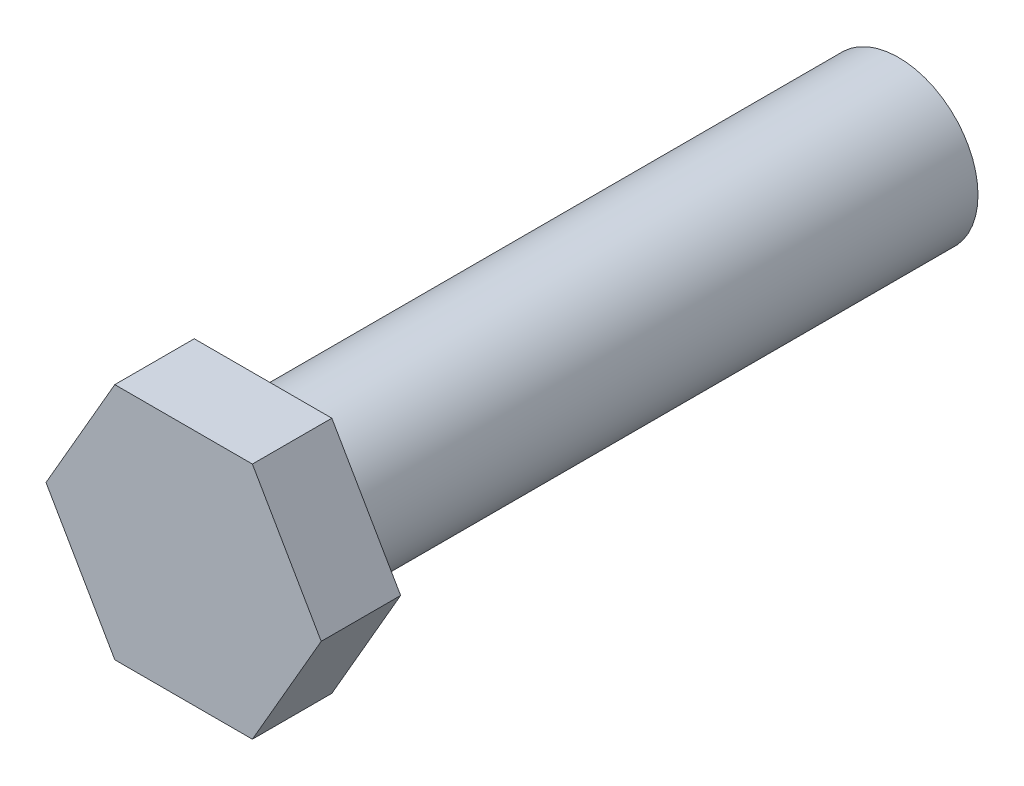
ISO-10303-21;
HEADER;
FILE_DESCRIPTION(('STEP AP214'),'2;1');
FILE_NAME('part.step','',(''),(''),'','','');
FILE_SCHEMA(('AUTOMOTIVE_DESIGN { 1 0 10303 214 1 1 1 1 }'));
ENDSEC;
DATA;
#1=APPLICATION_CONTEXT('core data for automotive mechanical design processes');
#2=APPLICATION_PROTOCOL_DEFINITION('international standard','automotive_design',2000,#1);
#3=PRODUCT_CONTEXT('',#1,'mechanical');
#4=PRODUCT('Part','Part','',(#3));
#5=PRODUCT_RELATED_PRODUCT_CATEGORY('part','',(#4));
#6=PRODUCT_DEFINITION_FORMATION('','',#4);
#7=PRODUCT_DEFINITION_CONTEXT('part definition',#1,'design');
#8=PRODUCT_DEFINITION('design','',#6,#7);
#9=PRODUCT_DEFINITION_SHAPE('','',#8);
#10=(LENGTH_UNIT() NAMED_UNIT(*) SI_UNIT(.MILLI.,.METRE.));
#11=(NAMED_UNIT(*) PLANE_ANGLE_UNIT() SI_UNIT($,.RADIAN.));
#12=(NAMED_UNIT(*) SI_UNIT($,.STERADIAN.) SOLID_ANGLE_UNIT());
#13=UNCERTAINTY_MEASURE_WITH_UNIT(LENGTH_MEASURE(1.E-05),#10,'distance_accuracy_value','');
#14=(GEOMETRIC_REPRESENTATION_CONTEXT(3) GLOBAL_UNCERTAINTY_ASSIGNED_CONTEXT((#13)) GLOBAL_UNIT_ASSIGNED_CONTEXT((#10,
#11,#12)) REPRESENTATION_CONTEXT('',''));
#15=CARTESIAN_POINT('',(0.,0.,0.));
#16=DIRECTION('',(0.,0.,1.));
#17=DIRECTION('',(1.,0.,0.));
#18=AXIS2_PLACEMENT_3D('',#15,#16,#17);
#19=CARTESIAN_POINT('',(0.,0.,40.));
#20=DIRECTION('',(0.,0.,-1.));
#21=DIRECTION('',(-1.,0.,0.));
#22=AXIS2_PLACEMENT_3D('',#19,#20,#21);
#23=CYLINDRICAL_SURFACE('',#22,5.);
#24=CARTESIAN_POINT('',(0.,0.,40.));
#25=DIRECTION('',(0.,0.,1.));
#26=DIRECTION('',(1.,0.,0.));
#27=AXIS2_PLACEMENT_3D('',#24,#25,#26);
#28=CIRCLE('',#27,5.);
#29=CARTESIAN_POINT('',(5.,0.,40.));
#30=VERTEX_POINT('',#29);
#31=EDGE_CURVE('E11',#30,#30,#28,.T.);
#32=ORIENTED_EDGE('',*,*,#31,.F.);
#33=EDGE_LOOP('',(#32));
#34=FACE_BOUND('',#33,.T.);
#35=CARTESIAN_POINT('',(0.,0.,0.));
#36=DIRECTION('',(0.,0.,1.));
#37=DIRECTION('',(1.,0.,0.));
#38=AXIS2_PLACEMENT_3D('',#35,#36,#37);
#39=CIRCLE('',#38,5.);
#40=CARTESIAN_POINT('',(5.,0.,0.));
#41=VERTEX_POINT('',#40);
#42=EDGE_CURVE('E357',#41,#41,#39,.T.);
#43=ORIENTED_EDGE('',*,*,#42,.T.);
#44=EDGE_LOOP('',(#43));
#45=FACE_BOUND('',#44,.T.);
#46=ADVANCED_FACE('F350',(#34,#45),#23,.T.);
#47=CARTESIAN_POINT('',(0.,0.,0.));
#48=DIRECTION('',(0.,0.,1.));
#49=DIRECTION('',(1.,0.,0.));
#50=AXIS2_PLACEMENT_3D('',#47,#48,#49);
#51=PLANE('',#50);
#52=ORIENTED_EDGE('',*,*,#42,.F.);
#53=EDGE_LOOP('',(#52));
#54=FACE_BOUND('',#53,.T.);
#55=ADVANCED_FACE('F458',(#54),#51,.F.);
#56=CARTESIAN_POINT('',(4.3301270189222,-7.5,40.));
#57=DIRECTION('',(0.,0.,-1.));
#58=DIRECTION('',(-1.,0.,0.));
#59=AXIS2_PLACEMENT_3D('',#56,#57,#58);
#60=PLANE('',#59);
#61=DIRECTION('',(0.5,0.866025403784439,0.));
#62=VECTOR('',#61,1.);
#63=CARTESIAN_POINT('',(4.33012701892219,-7.5,40.));
#64=LINE('',#63,#62);
#65=CARTESIAN_POINT('',(4.33012701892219,-7.5,40.));
#66=VERTEX_POINT('',#65);
#67=CARTESIAN_POINT('',(8.66025403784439,0.,40.));
#68=VERTEX_POINT('',#67);
#69=EDGE_CURVE('E408',#66,#68,#64,.T.);
#70=ORIENTED_EDGE('',*,*,#69,.F.);
#71=DIRECTION('',(1.,0.,0.));
#72=VECTOR('',#71,1.);
#73=CARTESIAN_POINT('',(-4.3301270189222,-7.5,40.));
#74=LINE('',#73,#72);
#75=CARTESIAN_POINT('',(-4.3301270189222,-7.5,40.));
#76=VERTEX_POINT('',#75);
#77=EDGE_CURVE('E433',#76,#66,#74,.T.);
#78=ORIENTED_EDGE('',*,*,#77,.F.);
#79=DIRECTION('',(0.5,-0.866025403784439,0.));
#80=VECTOR('',#79,1.);
#81=CARTESIAN_POINT('',(-8.66025403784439,0.,40.));
#82=LINE('',#81,#80);
#83=CARTESIAN_POINT('',(-8.66025403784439,0.,40.));
#84=VERTEX_POINT('',#83);
#85=EDGE_CURVE('E431',#84,#76,#82,.T.);
#86=ORIENTED_EDGE('',*,*,#85,.F.);
#87=DIRECTION('',(-0.5,-0.866025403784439,0.));
#88=VECTOR('',#87,1.);
#89=CARTESIAN_POINT('',(-4.3301270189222,7.5,40.));
#90=LINE('',#89,#88);
#91=CARTESIAN_POINT('',(-4.3301270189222,7.5,40.));
#92=VERTEX_POINT('',#91);
#93=EDGE_CURVE('E429',#92,#84,#90,.T.);
#94=ORIENTED_EDGE('',*,*,#93,.F.);
#95=DIRECTION('',(-1.,0.,0.));
#96=VECTOR('',#95,1.);
#97=CARTESIAN_POINT('',(4.33012701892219,7.50000000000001,40.));
#98=LINE('',#97,#96);
#99=CARTESIAN_POINT('',(4.33012701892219,7.50000000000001,40.));
#100=VERTEX_POINT('',#99);
#101=EDGE_CURVE('E410',#100,#92,#98,.T.);
#102=ORIENTED_EDGE('',*,*,#101,.F.);
#103=DIRECTION('',(-0.5,0.866025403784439,0.));
#104=VECTOR('',#103,1.);
#105=CARTESIAN_POINT('',(8.66025403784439,0.,40.));
#106=LINE('',#105,#104);
#107=EDGE_CURVE('E402',#68,#100,#106,.T.);
#108=ORIENTED_EDGE('',*,*,#107,.F.);
#109=EDGE_LOOP('',(#70,#78,#86,#94,#102,#108));
#110=FACE_BOUND('',#109,.T.);
#111=ORIENTED_EDGE('',*,*,#31,.T.);
#112=EDGE_LOOP('',(#111));
#113=FACE_BOUND('',#112,.T.);
#114=ADVANCED_FACE('F404',(#110,#113),#60,.T.);
#115=CARTESIAN_POINT('',(4.33012701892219,-7.5,45.));
#116=DIRECTION('',(-0.866025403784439,0.5,0.));
#117=DIRECTION('',(-0.5,-0.866025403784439,0.));
#118=AXIS2_PLACEMENT_3D('',#115,#116,#117);
#119=PLANE('',#118);
#120=ORIENTED_EDGE('',*,*,#69,.T.);
#121=DIRECTION('',(0.,0.,-1.));
#122=VECTOR('',#121,1.);
#123=CARTESIAN_POINT('',(8.66025403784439,0.,45.));
#124=LINE('',#123,#122);
#125=CARTESIAN_POINT('',(8.66025403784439,0.,45.));
#126=VERTEX_POINT('',#125);
#127=EDGE_CURVE('E416',#126,#68,#124,.T.);
#128=ORIENTED_EDGE('',*,*,#127,.F.);
#129=DIRECTION('',(0.5,0.866025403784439,0.));
#130=VECTOR('',#129,1.);
#131=CARTESIAN_POINT('',(4.33012701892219,-7.5,45.));
#132=LINE('',#131,#130);
#133=CARTESIAN_POINT('',(4.33012701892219,-7.5,45.));
#134=VERTEX_POINT('',#133);
#135=EDGE_CURVE('E435',#134,#126,#132,.T.);
#136=ORIENTED_EDGE('',*,*,#135,.F.);
#137=DIRECTION('',(0.,0.,-1.));
#138=VECTOR('',#137,1.);
#139=CARTESIAN_POINT('',(4.33012701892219,-7.5,45.));
#140=LINE('',#139,#138);
#141=EDGE_CURVE('E425',#134,#66,#140,.T.);
#142=ORIENTED_EDGE('',*,*,#141,.T.);
#143=EDGE_LOOP('',(#120,#128,#136,#142));
#144=FACE_BOUND('',#143,.T.);
#145=ADVANCED_FACE('F424',(#144),#119,.F.);
#146=CARTESIAN_POINT('',(8.66025403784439,0.,45.));
#147=DIRECTION('',(-0.866025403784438,-0.5,0.));
#148=DIRECTION('',(0.5,-0.866025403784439,0.));
#149=AXIS2_PLACEMENT_3D('',#146,#147,#148);
#150=PLANE('',#149);
#151=ORIENTED_EDGE('',*,*,#107,.T.);
#152=DIRECTION('',(0.,0.,-1.));
#153=VECTOR('',#152,1.);
#154=CARTESIAN_POINT('',(4.33012701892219,7.50000000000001,45.));
#155=LINE('',#154,#153);
#156=CARTESIAN_POINT('',(4.33012701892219,7.50000000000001,45.));
#157=VERTEX_POINT('',#156);
#158=EDGE_CURVE('E421',#157,#100,#155,.T.);
#159=ORIENTED_EDGE('',*,*,#158,.F.);
#160=DIRECTION('',(-0.5,0.866025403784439,0.));
#161=VECTOR('',#160,1.);
#162=CARTESIAN_POINT('',(8.66025403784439,0.,45.));
#163=LINE('',#162,#161);
#164=EDGE_CURVE('E418',#126,#157,#163,.T.);
#165=ORIENTED_EDGE('',*,*,#164,.F.);
#166=ORIENTED_EDGE('',*,*,#127,.T.);
#167=EDGE_LOOP('',(#151,#159,#165,#166));
#168=FACE_BOUND('',#167,.T.);
#169=ADVANCED_FACE('F417',(#168),#150,.F.);
#170=CARTESIAN_POINT('',(4.33012701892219,7.50000000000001,45.));
#171=DIRECTION('',(0.,-1.,0.));
#172=DIRECTION('',(1.,0.,0.));
#173=AXIS2_PLACEMENT_3D('',#170,#171,#172);
#174=PLANE('',#173);
#175=ORIENTED_EDGE('',*,*,#101,.T.);
#176=DIRECTION('',(0.,0.,-1.));
#177=VECTOR('',#176,1.);
#178=CARTESIAN_POINT('',(-4.3301270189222,7.5,45.));
#179=LINE('',#178,#177);
#180=CARTESIAN_POINT('',(-4.3301270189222,7.5,45.));
#181=VERTEX_POINT('',#180);
#182=EDGE_CURVE('E451',#181,#92,#179,.T.);
#183=ORIENTED_EDGE('',*,*,#182,.F.);
#184=DIRECTION('',(-1.,0.,0.));
#185=VECTOR('',#184,1.);
#186=CARTESIAN_POINT('',(4.33012701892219,7.50000000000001,45.));
#187=LINE('',#186,#185);
#188=EDGE_CURVE('E438',#157,#181,#187,.T.);
#189=ORIENTED_EDGE('',*,*,#188,.F.);
#190=ORIENTED_EDGE('',*,*,#158,.T.);
#191=EDGE_LOOP('',(#175,#183,#189,#190));
#192=FACE_BOUND('',#191,.T.);
#193=ADVANCED_FACE('F471',(#192),#174,.F.);
#194=CARTESIAN_POINT('',(-4.3301270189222,7.5,45.));
#195=DIRECTION('',(0.866025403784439,-0.5,0.));
#196=DIRECTION('',(0.5,0.866025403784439,0.));
#197=AXIS2_PLACEMENT_3D('',#194,#195,#196);
#198=PLANE('',#197);
#199=ORIENTED_EDGE('',*,*,#93,.T.);
#200=DIRECTION('',(0.,0.,-1.));
#201=VECTOR('',#200,1.);
#202=CARTESIAN_POINT('',(-8.66025403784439,0.,45.));
#203=LINE('',#202,#201);
#204=CARTESIAN_POINT('',(-8.66025403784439,0.,45.));
#205=VERTEX_POINT('',#204);
#206=EDGE_CURVE('E448',#205,#84,#203,.T.);
#207=ORIENTED_EDGE('',*,*,#206,.F.);
#208=DIRECTION('',(-0.5,-0.866025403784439,0.));
#209=VECTOR('',#208,1.);
#210=CARTESIAN_POINT('',(-4.3301270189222,7.5,45.));
#211=LINE('',#210,#209);
#212=EDGE_CURVE('E440',#181,#205,#211,.T.);
#213=ORIENTED_EDGE('',*,*,#212,.F.);
#214=ORIENTED_EDGE('',*,*,#182,.T.);
#215=EDGE_LOOP('',(#199,#207,#213,#214));
#216=FACE_BOUND('',#215,.T.);
#217=ADVANCED_FACE('F474',(#216),#198,.F.);
#218=CARTESIAN_POINT('',(-8.66025403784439,0.,45.));
#219=DIRECTION('',(0.866025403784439,0.5,0.));
#220=DIRECTION('',(-0.5,0.866025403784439,0.));
#221=AXIS2_PLACEMENT_3D('',#218,#219,#220);
#222=PLANE('',#221);
#223=ORIENTED_EDGE('',*,*,#85,.T.);
#224=DIRECTION('',(0.,0.,-1.));
#225=VECTOR('',#224,1.);
#226=CARTESIAN_POINT('',(-4.3301270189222,-7.5,45.));
#227=LINE('',#226,#225);
#228=CARTESIAN_POINT('',(-4.3301270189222,-7.5,45.));
#229=VERTEX_POINT('',#228);
#230=EDGE_CURVE('E445',#229,#76,#227,.T.);
#231=ORIENTED_EDGE('',*,*,#230,.F.);
#232=DIRECTION('',(0.5,-0.866025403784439,0.));
#233=VECTOR('',#232,1.);
#234=CARTESIAN_POINT('',(-8.66025403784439,0.,45.));
#235=LINE('',#234,#233);
#236=EDGE_CURVE('E369',#205,#229,#235,.T.);
#237=ORIENTED_EDGE('',*,*,#236,.F.);
#238=ORIENTED_EDGE('',*,*,#206,.T.);
#239=EDGE_LOOP('',(#223,#231,#237,#238));
#240=FACE_BOUND('',#239,.T.);
#241=ADVANCED_FACE('F478',(#240),#222,.F.);
#242=CARTESIAN_POINT('',(-4.3301270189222,-7.5,45.));
#243=DIRECTION('',(0.,1.,0.));
#244=DIRECTION('',(-1.,0.,0.));
#245=AXIS2_PLACEMENT_3D('',#242,#243,#244);
#246=PLANE('',#245);
#247=ORIENTED_EDGE('',*,*,#77,.T.);
#248=ORIENTED_EDGE('',*,*,#141,.F.);
#249=DIRECTION('',(1.,0.,0.));
#250=VECTOR('',#249,1.);
#251=CARTESIAN_POINT('',(-4.3301270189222,-7.5,45.));
#252=LINE('',#251,#250);
#253=EDGE_CURVE('E364',#229,#134,#252,.T.);
#254=ORIENTED_EDGE('',*,*,#253,.F.);
#255=ORIENTED_EDGE('',*,*,#230,.T.);
#256=EDGE_LOOP('',(#247,#248,#254,#255));
#257=FACE_BOUND('',#256,.T.);
#258=ADVANCED_FACE('F482',(#257),#246,.F.);
#259=CARTESIAN_POINT('',(4.3301270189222,-7.5,45.));
#260=DIRECTION('',(0.,0.,-1.));
#261=DIRECTION('',(-1.,0.,0.));
#262=AXIS2_PLACEMENT_3D('',#259,#260,#261);
#263=PLANE('',#262);
#264=ORIENTED_EDGE('',*,*,#135,.T.);
#265=ORIENTED_EDGE('',*,*,#164,.T.);
#266=ORIENTED_EDGE('',*,*,#188,.T.);
#267=ORIENTED_EDGE('',*,*,#212,.T.);
#268=ORIENTED_EDGE('',*,*,#236,.T.);
#269=ORIENTED_EDGE('',*,*,#253,.T.);
#270=EDGE_LOOP('',(#264,#265,#266,#267,#268,#269));
#271=FACE_BOUND('',#270,.T.);
#272=ADVANCED_FACE('F486',(#271),#263,.F.);
#273=CLOSED_SHELL('',(#46,#55,#114,#145,#169,#193,#217,#241,#258,#272));
#274=MANIFOLD_SOLID_BREP('B2',#273);
#275=ADVANCED_BREP_SHAPE_REPRESENTATION('',(#18,#274),#14);
#276=SHAPE_DEFINITION_REPRESENTATION(#9,#275);
ENDSEC;
END-ISO-10303-21;
